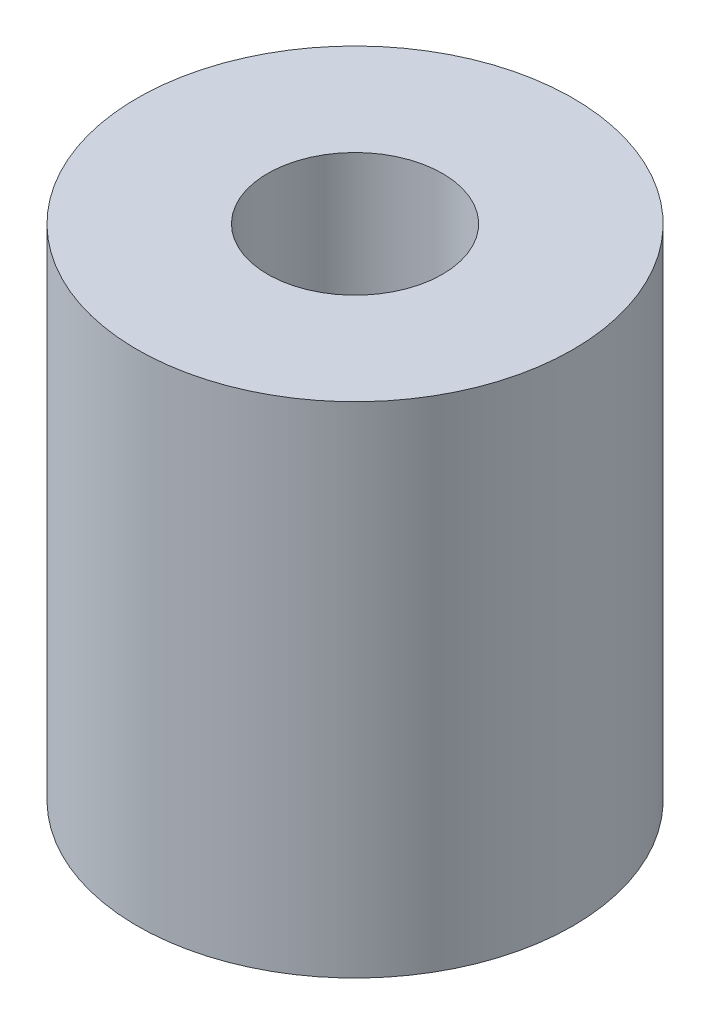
from build123d import *

# Parameters (mm, degrees)
ESQUISSE1_W = 4.73
ESQUISSE1_H = 18.1


with BuildPart() as part:
    # Esquisse1 → R_volution1 (revolve)
    with BuildSketch(Plane.XY):
        with Locations((5.535, 0)):
            Rectangle(ESQUISSE1_W, ESQUISSE1_H)
    revolve(axis=Axis((0, 9.05, 0), (0, -1, 0)))


solid = part.part
